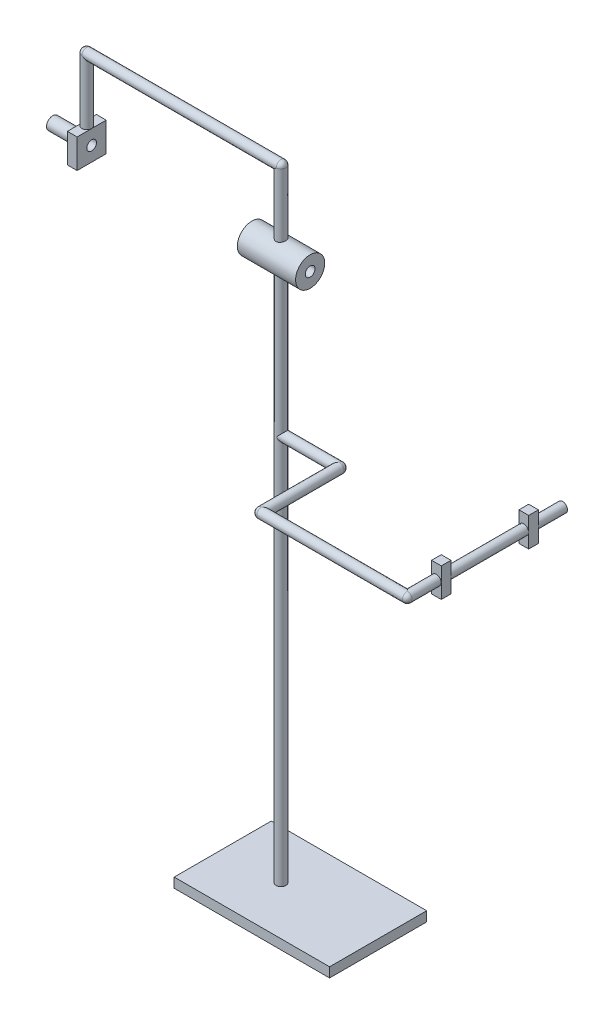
from build123d import *

# Parameters (mm, degrees)
ESQUISSE1_W             = 2.5
ESQUISSE1_H             = 180
BOSS_EXTRU_1_DEPTH      = 15
BOSS_EXTRU_1_DEPTH_BACK = 15
ESQUISSE2_R             = 7.5
ESQUISSE3_R             = 2.5
ENL_V_MAT_EXTRU_2_DEPTH = 105.672107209
ESQUISSE4_W             = 2.5
ESQUISSE4_H             = 37.5
ESQUISSE6_R             = 2.5
BOSS_EXTRU_4_DEPTH      = 100
ESQUISSE8_W             = 2.5
ESQUISSE8_H             = 32.5
ESQUISSE10_W            = 5
ESQUISSE10_H            = 15
BOSS_EXTRU_5_DEPTH      = 15
ESQUISSE11_R            = 2.5
ENL_V_MAT_EXTRU_3_DEPTH = 167.48948923
ESQUISSE12_R            = 3.25
ESQUISSE12_R_2          = 2.5
BOSS_EXTRU_6_DEPTH      = 15
ESQUISSE13_W            = 30
ESQUISSE13_H            = 2.5
ESQUISSE14_R            = 2.5
BOSS_EXTRU_7_DEPTH      = 40
ESQUISSE16_W            = 75
ESQUISSE16_H            = 2.5
ESQUISSE18_W            = 2.5
ESQUISSE18_H            = 80
ESQUISSE20_R            = 2.5
BOSS_EXTRU_8_DEPTH      = 100
ESQUISSE21_W            = 80
ESQUISSE21_H            = 50
BOSS_EXTRU_9_DEPTH      = 5
ESQUISSE22_W            = 5
ESQUISSE22_H            = 15
BOSS_EXTRU_10_DEPTH     = 5
BOSS_EXTRU_11_START     = -5
BOSS_EXTRU_11_DEPTH     = 5


with BuildPart() as part:
    # Esquisse1 → Base-R_volution (revolve)
    with BuildSketch(Plane.XY, mode=Mode.PRIVATE) as base_r_volution_sk:
        with Locations((-1.25, -10)):
            Rectangle(ESQUISSE1_W, ESQUISSE1_H)
    revolve(base_r_volution_sk.sketch.rotate(Axis((0, -100, 0), (0, 1, 0)), 270), axis=Axis((0, -100, 0), (0, 1, 0)))

    # Esquisse2 → Boss.-Extru.1 (add, two sides: drawn at the far end of the back side and taken through both)
    with BuildSketch(Plane(origin=(0, 0, 0), x_dir=(0, 0, -1), z_dir=(1, 0, 0)).offset(-BOSS_EXTRU_1_DEPTH_BACK)):
        with Locations((0, 80)):
            Circle(ESQUISSE2_R)
    extrude(amount=BOSS_EXTRU_1_DEPTH + BOSS_EXTRU_1_DEPTH_BACK)

    # Esquisse3 → Enl_v. mat.-Extru.2 (cut, through all)
    with BuildSketch(Plane(origin=(15, 0, 0), x_dir=(0, 0, -1), z_dir=(1, 0, 0))):
        with Locations((0, 80)):
            Circle(ESQUISSE3_R)
    extrude(amount=-ENL_V_MAT_EXTRU_2_DEPTH, mode=Mode.SUBTRACT)

    # Esquisse4 → Boss.-R_vol.2 (revolve)
    with BuildSketch(Plane.XY, mode=Mode.PRIVATE) as boss_r_vol_2_sk:
        with Locations((-1.25, 101.25)):
            Rectangle(ESQUISSE4_W, ESQUISSE4_H)
    revolve(boss_r_vol_2_sk.sketch.rotate(Axis((0, 70, 0), (0, 1, 0)), 270), axis=Axis((0, 70, 0), (0, 1, 0)))

    # Esquisse6 → Boss.-Extru.4 (add)
    with BuildSketch(Plane(origin=(0, 0, 0), x_dir=(0, 0, -1), z_dir=(1, 0, 0))):
        with Locations((0, 120)):
            Circle(ESQUISSE6_R)
    extrude(amount=-BOSS_EXTRU_4_DEPTH)

    # Esquisse7 → Boss.-R_vol.3 (revolve)
    with BuildSketch(Plane(origin=(0, 0, 0), x_dir=(0, 0, -1), z_dir=(1, 0, 0))):
        with BuildLine():
            Line((-2.5, 120), (2.5, 120))
            ThreePointArc((2.5, 120), (0, 122.5), (-2.5, 120))
        make_face()
    revolve(axis=Axis((0, 120, 10), (0, 0, -1)))

    # Esquisse8 → Boss.-R_vol.4 (revolve)
    with BuildSketch(Plane.XY, mode=Mode.PRIVATE) as boss_r_vol_4_sk:
        with Locations((-98.75, 103.75)):
            Rectangle(ESQUISSE8_W, ESQUISSE8_H)
    revolve(boss_r_vol_4_sk.sketch.rotate(Axis((-100, 120, 0), (0, -1, 0)), 90), axis=Axis((-100, 120, 0), (0, -1, 0)))

    # Esquisse9 → Boss.-R_vol.5 (revolve)
    with BuildSketch(Plane(origin=(0, 120, 0), x_dir=(-1, 0, 0), z_dir=(0, 1, 0))):
        with BuildLine():
            Line((100, 2.5), (100, -2.5))
            ThreePointArc((100, -2.5), (102.5, 0), (100, 2.5))
        make_face()
    revolve(axis=Axis((-100, 120, 0), (0, 0, -1)))

    # Esquisse10 → Boss.-Extru.5 (add)
    with BuildSketch(Plane.XZ.offset(-87.5)):
        with Locations((-100, 0)):
            Rectangle(ESQUISSE10_W, ESQUISSE10_H)
    extrude(amount=BOSS_EXTRU_5_DEPTH)

    # Esquisse11 → Enl_v. mat.-Extru.3 (cut, through all)
    with BuildSketch(Plane(origin=(-97.5, 0, 0), x_dir=(0, 0, -1), z_dir=(1, 0, 0))):
        with Locations((0, 80)):
            Circle(ESQUISSE11_R)
    extrude(amount=-ENL_V_MAT_EXTRU_3_DEPTH, mode=Mode.SUBTRACT)

    # Esquisse12 → Boss.-Extru.6 (add)
    with BuildSketch(Plane.ZY.offset(102.5)):
        with Locations(Location((0, 80, 0), (0, 0, 180))):
            Circle(ESQUISSE12_R)
        with Locations(Location((0, 80, 0), (0, 0, 180))):
            Circle(ESQUISSE12_R_2, mode=Mode.SUBTRACT)
    extrude(amount=BOSS_EXTRU_6_DEPTH)

    # Esquisse13 → Boss.-R_vol.6 (revolve)
    with BuildSketch(Plane.XY, mode=Mode.PRIVATE) as boss_r_vol_6_sk:
        with Locations((15, 1.25)):
            Rectangle(ESQUISSE13_W, ESQUISSE13_H)
    revolve(boss_r_vol_6_sk.sketch.rotate(Axis((0, 0, 0), (1, 0, 0)), 90), axis=Axis((0, 0, 0), (1, 0, 0)))

    # Esquisse14 → Boss.-Extru.7 (add)
    with BuildSketch(Plane.XY):
        with Locations(Location((30, 0, 0), (0, 0, 90))):
            Circle(ESQUISSE14_R)
    extrude(amount=BOSS_EXTRU_7_DEPTH)

    # Esquisse15 → Boss.-R_vol.7 (revolve)
    with BuildSketch(Plane(origin=(30, 0, 0), x_dir=(0, 0, -1), z_dir=(1, 0, 0))):
        with BuildLine():
            Line((0, 2.5), (0, -2.5))
            ThreePointArc((0, -2.5), (2.5, 0), (0, 2.5))
        make_face()
    revolve(axis=Axis((30, 0, 0), (0, -1, 0)))

    # Esquisse16 → Boss.-R_vol.8 (revolve)
    with BuildSketch(Plane(origin=(0, 0, 0), x_dir=(1, 0, 0), z_dir=(0, 1, 0)), mode=Mode.PRIVATE) as boss_r_vol_8_sk:
        with Locations((67.5, -38.75)):
            Rectangle(ESQUISSE16_W, ESQUISSE16_H)
    revolve(boss_r_vol_8_sk.sketch.rotate(Axis((30, 0, 40), (1, 0, 0)), 90), axis=Axis((30, 0, 40), (1, 0, 0)))

    # Esquisse17 → Boss.-R_vol.9 (revolve)
    with BuildSketch(Plane.XY.offset(40)):
        with BuildLine():
            Line((30, -2.5), (30, 2.5))
            ThreePointArc((30, 2.5), (27.5, 0), (30, -2.5))
        make_face()
    revolve(axis=Axis((30, 10, 40), (0, -1, 0)))

    # Esquisse18 → Boss.-R_vol.10 (revolve)
    with BuildSketch(Plane(origin=(0, 0, 0), x_dir=(1, 0, 0), z_dir=(0, 1, 0))):
        with Locations((106.25, 0)):
            Rectangle(ESQUISSE18_W, ESQUISSE18_H)
    revolve(axis=Axis((105, 0, 42.215532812), (0, 0, -1)))

    # Esquisse19 → Boss.-R_vol.11 (revolve)
    with BuildSketch(Plane.XY.offset(40)):
        with BuildLine():
            Line((105, 2.5), (105, -2.5))
            ThreePointArc((105, -2.5), (107.5, 0), (105, 2.5))
        make_face()
    revolve(axis=Axis((105, 18.208241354, 40), (0, -1, 0)))

    # Esquisse20 → Boss.-Extru.8 (add)
    with BuildSketch(Plane.XZ.offset(100)):
        with Locations(Location((0, 0, 0), (0, 0, 270))):
            Circle(ESQUISSE20_R)
    extrude(amount=BOSS_EXTRU_8_DEPTH)

    # Esquisse21 → Boss.-Extru.9 (add)
    with BuildSketch(Plane.XZ.offset(200)):
        with Locations((10, 0)):
            Rectangle(ESQUISSE21_W, ESQUISSE21_H)
    extrude(amount=BOSS_EXTRU_9_DEPTH)

    # Esquisse22 → Boss.-Extru.10 (add)
    with BuildSketch(Plane.XY.offset(25)):
        with Locations((105, 0)):
            Rectangle(ESQUISSE22_W, ESQUISSE22_H)
    extrude(amount=-BOSS_EXTRU_10_DEPTH)

    # Esquisse23 → Boss.-Extru.11 (add)
    with BuildSketch(Plane(origin=(0, 0, -25), x_dir=(-1, 0, 0), z_dir=(0, 0, -1)).offset(BOSS_EXTRU_11_START)):
        with BuildLine():
            ThreePointArc((-107.5, 0), (-105, 2.5), (-102.5, 0))
            Line((-102.5, 0), (-102.5, 7.5))
            Line((-102.5, 7.5), (-107.5, 7.5))
            Line((-107.5, 7.5), (-107.5, 0))
        make_face()
        with BuildLine():
            ThreePointArc((-107.5, 0), (-105, -2.5), (-102.5, 0))
            ThreePointArc((-102.5, 0), (-105, 2.5), (-107.5, 0))
        make_face()
        with BuildLine():
            Line((-102.5, -7.5), (-102.5, 0))
            ThreePointArc((-102.5, 0), (-105, -2.5), (-107.5, 0))
            Line((-107.5, 0), (-107.5, -7.5))
            Line((-107.5, -7.5), (-102.5, -7.5))
        make_face()
    extrude(amount=BOSS_EXTRU_11_DEPTH)


solid = part.part
